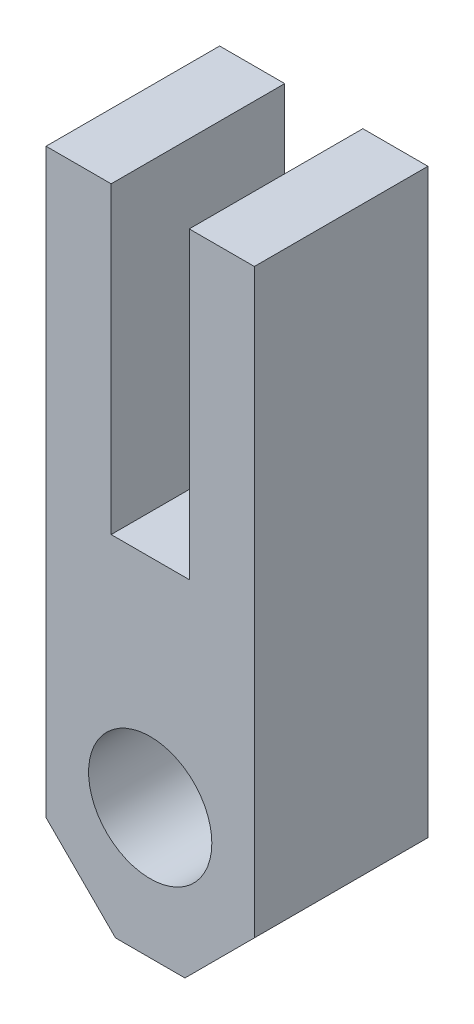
ISO-10303-21;
HEADER;
FILE_DESCRIPTION(('STEP AP214'),'2;1');
FILE_NAME('part.step','',(''),(''),'','','');
FILE_SCHEMA(('AUTOMOTIVE_DESIGN { 1 0 10303 214 1 1 1 1 }'));
ENDSEC;
DATA;
#1=APPLICATION_CONTEXT('core data for automotive mechanical design processes');
#2=APPLICATION_PROTOCOL_DEFINITION('international standard','automotive_design',2000,#1);
#3=PRODUCT_CONTEXT('',#1,'mechanical');
#4=PRODUCT('Part','Part','',(#3));
#5=PRODUCT_RELATED_PRODUCT_CATEGORY('part','',(#4));
#6=PRODUCT_DEFINITION_FORMATION('','',#4);
#7=PRODUCT_DEFINITION_CONTEXT('part definition',#1,'design');
#8=PRODUCT_DEFINITION('design','',#6,#7);
#9=PRODUCT_DEFINITION_SHAPE('','',#8);
#10=(LENGTH_UNIT() NAMED_UNIT(*) SI_UNIT(.MILLI.,.METRE.));
#11=(NAMED_UNIT(*) PLANE_ANGLE_UNIT() SI_UNIT($,.RADIAN.));
#12=(NAMED_UNIT(*) SI_UNIT($,.STERADIAN.) SOLID_ANGLE_UNIT());
#13=UNCERTAINTY_MEASURE_WITH_UNIT(LENGTH_MEASURE(1.E-05),#10,'distance_accuracy_value','');
#14=(GEOMETRIC_REPRESENTATION_CONTEXT(3) GLOBAL_UNCERTAINTY_ASSIGNED_CONTEXT((#13)) GLOBAL_UNIT_ASSIGNED_CONTEXT((#10,
#11,#12)) REPRESENTATION_CONTEXT('',''));
#15=CARTESIAN_POINT('',(0.,0.,0.));
#16=DIRECTION('',(0.,0.,1.));
#17=DIRECTION('',(1.,0.,0.));
#18=AXIS2_PLACEMENT_3D('',#15,#16,#17);
#19=CARTESIAN_POINT('',(-4.5,60.,20.));
#20=DIRECTION('',(0.,0.,1.));
#21=DIRECTION('',(1.,0.,0.));
#22=AXIS2_PLACEMENT_3D('',#19,#20,#21);
#23=PLANE('',#22);
#24=DIRECTION('',(0.,1.,0.));
#25=VECTOR('',#24,1.);
#26=CARTESIAN_POINT('',(-4.5,25.,20.));
#27=LINE('',#26,#25);
#28=CARTESIAN_POINT('',(-4.5,25.,20.));
#29=VERTEX_POINT('',#28);
#30=CARTESIAN_POINT('',(-4.5,60.,20.));
#31=VERTEX_POINT('',#30);
#32=EDGE_CURVE('E162',#29,#31,#27,.T.);
#33=ORIENTED_EDGE('',*,*,#32,.T.);
#34=DIRECTION('',(-1.,0.,0.));
#35=VECTOR('',#34,1.);
#36=CARTESIAN_POINT('',(-4.5,60.,20.));
#37=LINE('',#36,#35);
#38=CARTESIAN_POINT('',(-12.,60.,20.));
#39=VERTEX_POINT('',#38);
#40=EDGE_CURVE('E100',#31,#39,#37,.T.);
#41=ORIENTED_EDGE('',*,*,#40,.T.);
#42=DIRECTION('',(0.,-1.,0.));
#43=VECTOR('',#42,1.);
#44=CARTESIAN_POINT('',(-12.,60.,20.));
#45=LINE('',#44,#43);
#46=CARTESIAN_POINT('',(-12.,-7.,20.));
#47=VERTEX_POINT('',#46);
#48=EDGE_CURVE('E183',#39,#47,#45,.T.);
#49=ORIENTED_EDGE('',*,*,#48,.T.);
#50=DIRECTION('',(0.707106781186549,-0.707106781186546,0.));
#51=VECTOR('',#50,1.);
#52=CARTESIAN_POINT('',(-12.,-7.,20.));
#53=LINE('',#52,#51);
#54=CARTESIAN_POINT('',(-3.99999999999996,-15.,20.));
#55=VERTEX_POINT('',#54);
#56=EDGE_CURVE('E202',#47,#55,#53,.T.);
#57=ORIENTED_EDGE('',*,*,#56,.T.);
#58=DIRECTION('',(1.,0.,0.));
#59=VECTOR('',#58,1.);
#60=CARTESIAN_POINT('',(-3.99999999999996,-15.,20.));
#61=LINE('',#60,#59);
#62=CARTESIAN_POINT('',(3.99999999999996,-15.,20.));
#63=VERTEX_POINT('',#62);
#64=EDGE_CURVE('E199',#55,#63,#61,.T.);
#65=ORIENTED_EDGE('',*,*,#64,.T.);
#66=DIRECTION('',(0.707106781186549,0.707106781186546,0.));
#67=VECTOR('',#66,1.);
#68=CARTESIAN_POINT('',(12.,-7.,20.));
#69=LINE('',#68,#67);
#70=CARTESIAN_POINT('',(12.,-7.,20.));
#71=VERTEX_POINT('',#70);
#72=EDGE_CURVE('E201',#63,#71,#69,.T.);
#73=ORIENTED_EDGE('',*,*,#72,.T.);
#74=DIRECTION('',(0.,1.,0.));
#75=VECTOR('',#74,1.);
#76=CARTESIAN_POINT('',(12.,60.,20.));
#77=LINE('',#76,#75);
#78=CARTESIAN_POINT('',(12.,60.,20.));
#79=VERTEX_POINT('',#78);
#80=EDGE_CURVE('E125',#71,#79,#77,.T.);
#81=ORIENTED_EDGE('',*,*,#80,.T.);
#82=DIRECTION('',(-1.,0.,0.));
#83=VECTOR('',#82,1.);
#84=CARTESIAN_POINT('',(4.5,60.,20.));
#85=LINE('',#84,#83);
#86=CARTESIAN_POINT('',(4.5,60.,20.));
#87=VERTEX_POINT('',#86);
#88=EDGE_CURVE('E119',#79,#87,#85,.T.);
#89=ORIENTED_EDGE('',*,*,#88,.T.);
#90=DIRECTION('',(0.,-1.,0.));
#91=VECTOR('',#90,1.);
#92=CARTESIAN_POINT('',(4.5,25.,20.));
#93=LINE('',#92,#91);
#94=CARTESIAN_POINT('',(4.5,25.,20.));
#95=VERTEX_POINT('',#94);
#96=EDGE_CURVE('E123',#87,#95,#93,.T.);
#97=ORIENTED_EDGE('',*,*,#96,.T.);
#98=DIRECTION('',(-1.,0.,0.));
#99=VECTOR('',#98,1.);
#100=CARTESIAN_POINT('',(4.5,25.,20.));
#101=LINE('',#100,#99);
#102=EDGE_CURVE('E51',#95,#29,#101,.T.);
#103=ORIENTED_EDGE('',*,*,#102,.T.);
#104=EDGE_LOOP('',(#33,#41,#49,#57,#65,#73,#81,#89,#97,#103));
#105=FACE_BOUND('',#104,.T.);
#106=CARTESIAN_POINT('',(0.,0.,20.));
#107=DIRECTION('',(0.,0.,1.));
#108=DIRECTION('',(1.,0.,0.));
#109=AXIS2_PLACEMENT_3D('',#106,#107,#108);
#110=CIRCLE('',#109,7.1);
#111=CARTESIAN_POINT('',(7.1,0.,20.));
#112=VERTEX_POINT('',#111);
#113=EDGE_CURVE('E147',#112,#112,#110,.T.);
#114=ORIENTED_EDGE('',*,*,#113,.F.);
#115=EDGE_LOOP('',(#114));
#116=FACE_BOUND('',#115,.T.);
#117=ADVANCED_FACE('F34',(#105,#116),#23,.T.);
#118=CARTESIAN_POINT('',(-4.5,60.,0.));
#119=DIRECTION('',(0.,0.,1.));
#120=DIRECTION('',(1.,0.,0.));
#121=AXIS2_PLACEMENT_3D('',#118,#119,#120);
#122=PLANE('',#121);
#123=DIRECTION('',(0.,1.,0.));
#124=VECTOR('',#123,1.);
#125=CARTESIAN_POINT('',(-4.5,25.,0.));
#126=LINE('',#125,#124);
#127=CARTESIAN_POINT('',(-4.5,25.,0.));
#128=VERTEX_POINT('',#127);
#129=CARTESIAN_POINT('',(-4.5,60.,0.));
#130=VERTEX_POINT('',#129);
#131=EDGE_CURVE('E143',#128,#130,#126,.T.);
#132=ORIENTED_EDGE('',*,*,#131,.F.);
#133=DIRECTION('',(-1.,0.,0.));
#134=VECTOR('',#133,1.);
#135=CARTESIAN_POINT('',(4.5,25.,0.));
#136=LINE('',#135,#134);
#137=CARTESIAN_POINT('',(4.5,25.,0.));
#138=VERTEX_POINT('',#137);
#139=EDGE_CURVE('E92',#138,#128,#136,.T.);
#140=ORIENTED_EDGE('',*,*,#139,.F.);
#141=DIRECTION('',(0.,-1.,0.));
#142=VECTOR('',#141,1.);
#143=CARTESIAN_POINT('',(4.5,25.,0.));
#144=LINE('',#143,#142);
#145=CARTESIAN_POINT('',(4.5,60.,0.));
#146=VERTEX_POINT('',#145);
#147=EDGE_CURVE('E86',#146,#138,#144,.T.);
#148=ORIENTED_EDGE('',*,*,#147,.F.);
#149=DIRECTION('',(-1.,0.,0.));
#150=VECTOR('',#149,1.);
#151=CARTESIAN_POINT('',(4.5,60.,0.));
#152=LINE('',#151,#150);
#153=CARTESIAN_POINT('',(12.,60.,0.));
#154=VERTEX_POINT('',#153);
#155=EDGE_CURVE('E133',#154,#146,#152,.T.);
#156=ORIENTED_EDGE('',*,*,#155,.F.);
#157=DIRECTION('',(0.,1.,0.));
#158=VECTOR('',#157,1.);
#159=CARTESIAN_POINT('',(12.,60.,0.));
#160=LINE('',#159,#158);
#161=CARTESIAN_POINT('',(12.,-7.,0.));
#162=VERTEX_POINT('',#161);
#163=EDGE_CURVE('E157',#162,#154,#160,.T.);
#164=ORIENTED_EDGE('',*,*,#163,.F.);
#165=DIRECTION('',(0.707106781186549,0.707106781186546,0.));
#166=VECTOR('',#165,1.);
#167=CARTESIAN_POINT('',(12.,-7.,0.));
#168=LINE('',#167,#166);
#169=CARTESIAN_POINT('',(3.99999999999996,-15.,0.));
#170=VERTEX_POINT('',#169);
#171=EDGE_CURVE('E155',#170,#162,#168,.T.);
#172=ORIENTED_EDGE('',*,*,#171,.F.);
#173=DIRECTION('',(1.,0.,0.));
#174=VECTOR('',#173,1.);
#175=CARTESIAN_POINT('',(-3.99999999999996,-15.,0.));
#176=LINE('',#175,#174);
#177=CARTESIAN_POINT('',(-3.99999999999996,-15.,0.));
#178=VERTEX_POINT('',#177);
#179=EDGE_CURVE('E153',#178,#170,#176,.T.);
#180=ORIENTED_EDGE('',*,*,#179,.F.);
#181=DIRECTION('',(0.707106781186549,-0.707106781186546,0.));
#182=VECTOR('',#181,1.);
#183=CARTESIAN_POINT('',(-12.,-7.,0.));
#184=LINE('',#183,#182);
#185=CARTESIAN_POINT('',(-12.,-7.,0.));
#186=VERTEX_POINT('',#185);
#187=EDGE_CURVE('E151',#186,#178,#184,.T.);
#188=ORIENTED_EDGE('',*,*,#187,.F.);
#189=DIRECTION('',(0.,-1.,0.));
#190=VECTOR('',#189,1.);
#191=CARTESIAN_POINT('',(-12.,60.,0.));
#192=LINE('',#191,#190);
#193=CARTESIAN_POINT('',(-12.,60.,0.));
#194=VERTEX_POINT('',#193);
#195=EDGE_CURVE('E149',#194,#186,#192,.T.);
#196=ORIENTED_EDGE('',*,*,#195,.F.);
#197=DIRECTION('',(-1.,0.,0.));
#198=VECTOR('',#197,1.);
#199=CARTESIAN_POINT('',(-4.5,60.,0.));
#200=LINE('',#199,#198);
#201=EDGE_CURVE('E146',#130,#194,#200,.T.);
#202=ORIENTED_EDGE('',*,*,#201,.F.);
#203=EDGE_LOOP('',(#132,#140,#148,#156,#164,#172,#180,#188,#196,#202));
#204=FACE_BOUND('',#203,.T.);
#205=CARTESIAN_POINT('',(0.,0.,0.));
#206=DIRECTION('',(0.,0.,1.));
#207=DIRECTION('',(1.,0.,0.));
#208=AXIS2_PLACEMENT_3D('',#205,#206,#207);
#209=CIRCLE('',#208,7.1);
#210=CARTESIAN_POINT('',(7.1,0.,0.));
#211=VERTEX_POINT('',#210);
#212=EDGE_CURVE('E210',#211,#211,#209,.T.);
#213=ORIENTED_EDGE('',*,*,#212,.T.);
#214=EDGE_LOOP('',(#213));
#215=FACE_BOUND('',#214,.T.);
#216=ADVANCED_FACE('F187',(#204,#215),#122,.F.);
#217=CARTESIAN_POINT('',(-4.5,25.,20.));
#218=DIRECTION('',(-1.,0.,0.));
#219=DIRECTION('',(0.,0.,1.));
#220=AXIS2_PLACEMENT_3D('',#217,#218,#219);
#221=PLANE('',#220);
#222=ORIENTED_EDGE('',*,*,#131,.T.);
#223=DIRECTION('',(0.,0.,-1.));
#224=VECTOR('',#223,1.);
#225=CARTESIAN_POINT('',(-4.5,60.,20.));
#226=LINE('',#225,#224);
#227=EDGE_CURVE('E11',#31,#130,#226,.T.);
#228=ORIENTED_EDGE('',*,*,#227,.F.);
#229=ORIENTED_EDGE('',*,*,#32,.F.);
#230=DIRECTION('',(0.,0.,-1.));
#231=VECTOR('',#230,1.);
#232=CARTESIAN_POINT('',(-4.5,25.,20.));
#233=LINE('',#232,#231);
#234=EDGE_CURVE('E139',#29,#128,#233,.T.);
#235=ORIENTED_EDGE('',*,*,#234,.T.);
#236=EDGE_LOOP('',(#222,#228,#229,#235));
#237=FACE_BOUND('',#236,.T.);
#238=ADVANCED_FACE('F36',(#237),#221,.F.);
#239=CARTESIAN_POINT('',(-4.5,60.,20.));
#240=DIRECTION('',(0.,-1.,0.));
#241=DIRECTION('',(0.,0.,-1.));
#242=AXIS2_PLACEMENT_3D('',#239,#240,#241);
#243=PLANE('',#242);
#244=ORIENTED_EDGE('',*,*,#201,.T.);
#245=DIRECTION('',(0.,0.,-1.));
#246=VECTOR('',#245,1.);
#247=CARTESIAN_POINT('',(-12.,60.,20.));
#248=LINE('',#247,#246);
#249=EDGE_CURVE('E43',#39,#194,#248,.T.);
#250=ORIENTED_EDGE('',*,*,#249,.F.);
#251=ORIENTED_EDGE('',*,*,#40,.F.);
#252=ORIENTED_EDGE('',*,*,#227,.T.);
#253=EDGE_LOOP('',(#244,#250,#251,#252));
#254=FACE_BOUND('',#253,.T.);
#255=ADVANCED_FACE('F246',(#254),#243,.F.);
#256=CARTESIAN_POINT('',(-12.,60.,20.));
#257=DIRECTION('',(1.,0.,0.));
#258=DIRECTION('',(0.,1.,0.));
#259=AXIS2_PLACEMENT_3D('',#256,#257,#258);
#260=PLANE('',#259);
#261=ORIENTED_EDGE('',*,*,#195,.T.);
#262=DIRECTION('',(0.,0.,-1.));
#263=VECTOR('',#262,1.);
#264=CARTESIAN_POINT('',(-12.,-7.,20.));
#265=LINE('',#264,#263);
#266=EDGE_CURVE('E175',#47,#186,#265,.T.);
#267=ORIENTED_EDGE('',*,*,#266,.F.);
#268=ORIENTED_EDGE('',*,*,#48,.F.);
#269=ORIENTED_EDGE('',*,*,#249,.T.);
#270=EDGE_LOOP('',(#261,#267,#268,#269));
#271=FACE_BOUND('',#270,.T.);
#272=ADVANCED_FACE('F181',(#271),#260,.F.);
#273=CARTESIAN_POINT('',(-12.,-7.,20.));
#274=DIRECTION('',(0.707106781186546,0.707106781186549,0.));
#275=DIRECTION('',(-0.707106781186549,0.707106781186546,0.));
#276=AXIS2_PLACEMENT_3D('',#273,#274,#275);
#277=PLANE('',#276);
#278=ORIENTED_EDGE('',*,*,#187,.T.);
#279=DIRECTION('',(0.,0.,-1.));
#280=VECTOR('',#279,1.);
#281=CARTESIAN_POINT('',(-3.99999999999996,-15.,20.));
#282=LINE('',#281,#280);
#283=EDGE_CURVE('E172',#55,#178,#282,.T.);
#284=ORIENTED_EDGE('',*,*,#283,.F.);
#285=ORIENTED_EDGE('',*,*,#56,.F.);
#286=ORIENTED_EDGE('',*,*,#266,.T.);
#287=EDGE_LOOP('',(#278,#284,#285,#286));
#288=FACE_BOUND('',#287,.T.);
#289=ADVANCED_FACE('F193',(#288),#277,.F.);
#290=CARTESIAN_POINT('',(-3.99999999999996,-15.,20.));
#291=DIRECTION('',(0.,1.,0.));
#292=DIRECTION('',(0.,0.,1.));
#293=AXIS2_PLACEMENT_3D('',#290,#291,#292);
#294=PLANE('',#293);
#295=ORIENTED_EDGE('',*,*,#179,.T.);
#296=DIRECTION('',(0.,0.,-1.));
#297=VECTOR('',#296,1.);
#298=CARTESIAN_POINT('',(3.99999999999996,-15.,20.));
#299=LINE('',#298,#297);
#300=EDGE_CURVE('E169',#63,#170,#299,.T.);
#301=ORIENTED_EDGE('',*,*,#300,.F.);
#302=ORIENTED_EDGE('',*,*,#64,.F.);
#303=ORIENTED_EDGE('',*,*,#283,.T.);
#304=EDGE_LOOP('',(#295,#301,#302,#303));
#305=FACE_BOUND('',#304,.T.);
#306=ADVANCED_FACE('F197',(#305),#294,.F.);
#307=CARTESIAN_POINT('',(12.,-7.,20.));
#308=DIRECTION('',(-0.707106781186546,0.707106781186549,0.));
#309=DIRECTION('',(-0.707106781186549,-0.707106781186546,0.));
#310=AXIS2_PLACEMENT_3D('',#307,#308,#309);
#311=PLANE('',#310);
#312=ORIENTED_EDGE('',*,*,#171,.T.);
#313=DIRECTION('',(0.,0.,-1.));
#314=VECTOR('',#313,1.);
#315=CARTESIAN_POINT('',(12.,-7.,20.));
#316=LINE('',#315,#314);
#317=EDGE_CURVE('E166',#71,#162,#316,.T.);
#318=ORIENTED_EDGE('',*,*,#317,.F.);
#319=ORIENTED_EDGE('',*,*,#72,.F.);
#320=ORIENTED_EDGE('',*,*,#300,.T.);
#321=EDGE_LOOP('',(#312,#318,#319,#320));
#322=FACE_BOUND('',#321,.T.);
#323=ADVANCED_FACE('F236',(#322),#311,.F.);
#324=CARTESIAN_POINT('',(12.,60.,20.));
#325=DIRECTION('',(-1.,0.,0.));
#326=DIRECTION('',(0.,-1.,0.));
#327=AXIS2_PLACEMENT_3D('',#324,#325,#326);
#328=PLANE('',#327);
#329=ORIENTED_EDGE('',*,*,#163,.T.);
#330=DIRECTION('',(0.,0.,-1.));
#331=VECTOR('',#330,1.);
#332=CARTESIAN_POINT('',(12.,60.,20.));
#333=LINE('',#332,#331);
#334=EDGE_CURVE('E134',#79,#154,#333,.T.);
#335=ORIENTED_EDGE('',*,*,#334,.F.);
#336=ORIENTED_EDGE('',*,*,#80,.F.);
#337=ORIENTED_EDGE('',*,*,#317,.T.);
#338=EDGE_LOOP('',(#329,#335,#336,#337));
#339=FACE_BOUND('',#338,.T.);
#340=ADVANCED_FACE('F233',(#339),#328,.F.);
#341=CARTESIAN_POINT('',(4.5,60.,20.));
#342=DIRECTION('',(0.,-1.,0.));
#343=DIRECTION('',(0.,0.,-1.));
#344=AXIS2_PLACEMENT_3D('',#341,#342,#343);
#345=PLANE('',#344);
#346=ORIENTED_EDGE('',*,*,#155,.T.);
#347=DIRECTION('',(0.,0.,-1.));
#348=VECTOR('',#347,1.);
#349=CARTESIAN_POINT('',(4.5,60.,20.));
#350=LINE('',#349,#348);
#351=EDGE_CURVE('E130',#87,#146,#350,.T.);
#352=ORIENTED_EDGE('',*,*,#351,.F.);
#353=ORIENTED_EDGE('',*,*,#88,.F.);
#354=ORIENTED_EDGE('',*,*,#334,.T.);
#355=EDGE_LOOP('',(#346,#352,#353,#354));
#356=FACE_BOUND('',#355,.T.);
#357=ADVANCED_FACE('F131',(#356),#345,.F.);
#358=CARTESIAN_POINT('',(4.5,25.,20.));
#359=DIRECTION('',(1.,0.,0.));
#360=DIRECTION('',(0.,0.,-1.));
#361=AXIS2_PLACEMENT_3D('',#358,#359,#360);
#362=PLANE('',#361);
#363=ORIENTED_EDGE('',*,*,#147,.T.);
#364=DIRECTION('',(0.,0.,-1.));
#365=VECTOR('',#364,1.);
#366=CARTESIAN_POINT('',(4.5,25.,20.));
#367=LINE('',#366,#365);
#368=EDGE_CURVE('E135',#95,#138,#367,.T.);
#369=ORIENTED_EDGE('',*,*,#368,.F.);
#370=ORIENTED_EDGE('',*,*,#96,.F.);
#371=ORIENTED_EDGE('',*,*,#351,.T.);
#372=EDGE_LOOP('',(#363,#369,#370,#371));
#373=FACE_BOUND('',#372,.T.);
#374=ADVANCED_FACE('F137',(#373),#362,.F.);
#375=CARTESIAN_POINT('',(4.5,25.,20.));
#376=DIRECTION('',(0.,-1.,0.));
#377=DIRECTION('',(0.,0.,-1.));
#378=AXIS2_PLACEMENT_3D('',#375,#376,#377);
#379=PLANE('',#378);
#380=ORIENTED_EDGE('',*,*,#139,.T.);
#381=ORIENTED_EDGE('',*,*,#234,.F.);
#382=ORIENTED_EDGE('',*,*,#102,.F.);
#383=ORIENTED_EDGE('',*,*,#368,.T.);
#384=EDGE_LOOP('',(#380,#381,#382,#383));
#385=FACE_BOUND('',#384,.T.);
#386=ADVANCED_FACE('F226',(#385),#379,.F.);
#387=CARTESIAN_POINT('',(0.,0.,20.));
#388=DIRECTION('',(0.,0.,-1.));
#389=DIRECTION('',(-1.,0.,0.));
#390=AXIS2_PLACEMENT_3D('',#387,#388,#389);
#391=CYLINDRICAL_SURFACE('',#390,7.1);
#392=ORIENTED_EDGE('',*,*,#113,.T.);
#393=EDGE_LOOP('',(#392));
#394=FACE_BOUND('',#393,.T.);
#395=ORIENTED_EDGE('',*,*,#212,.F.);
#396=EDGE_LOOP('',(#395));
#397=FACE_BOUND('',#396,.T.);
#398=ADVANCED_FACE('F216',(#394,#397),#391,.F.);
#399=CLOSED_SHELL('',(#117,#216,#238,#255,#272,#289,#306,#323,#340,#357,#374,#386,#398));
#400=MANIFOLD_SOLID_BREP('B2',#399);
#401=ADVANCED_BREP_SHAPE_REPRESENTATION('',(#18,#400),#14);
#402=SHAPE_DEFINITION_REPRESENTATION(#9,#401);
ENDSEC;
END-ISO-10303-21;
